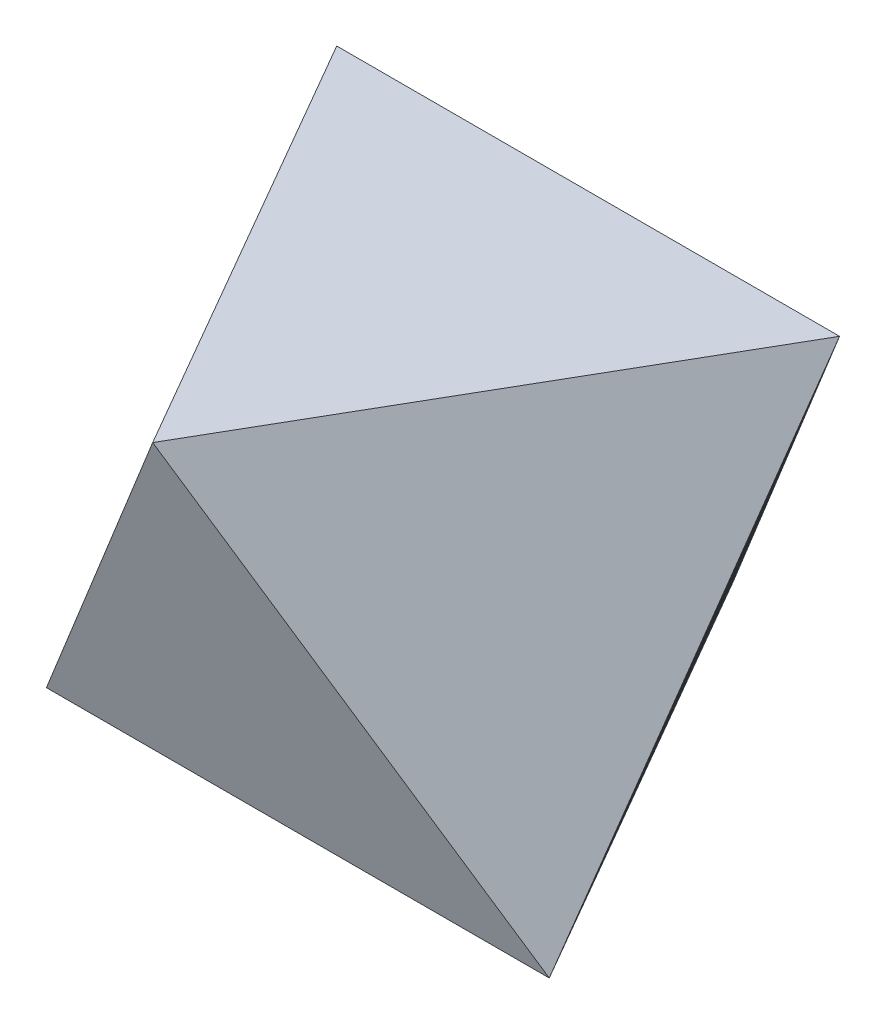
ISO-10303-21;
HEADER;
FILE_DESCRIPTION(('STEP AP214'),'2;1');
FILE_NAME('part.step','',(''),(''),'','','');
FILE_SCHEMA(('AUTOMOTIVE_DESIGN { 1 0 10303 214 1 1 1 1 }'));
ENDSEC;
DATA;
#1=APPLICATION_CONTEXT('core data for automotive mechanical design processes');
#2=APPLICATION_PROTOCOL_DEFINITION('international standard','automotive_design',2000,#1);
#3=PRODUCT_CONTEXT('',#1,'mechanical');
#4=PRODUCT('Part','Part','',(#3));
#5=PRODUCT_RELATED_PRODUCT_CATEGORY('part','',(#4));
#6=PRODUCT_DEFINITION_FORMATION('','',#4);
#7=PRODUCT_DEFINITION_CONTEXT('part definition',#1,'design');
#8=PRODUCT_DEFINITION('design','',#6,#7);
#9=PRODUCT_DEFINITION_SHAPE('','',#8);
#10=(LENGTH_UNIT() NAMED_UNIT(*) SI_UNIT(.MILLI.,.METRE.));
#11=(NAMED_UNIT(*) PLANE_ANGLE_UNIT() SI_UNIT($,.RADIAN.));
#12=(NAMED_UNIT(*) SI_UNIT($,.STERADIAN.) SOLID_ANGLE_UNIT());
#13=UNCERTAINTY_MEASURE_WITH_UNIT(LENGTH_MEASURE(1.E-05),#10,'distance_accuracy_value','');
#14=(GEOMETRIC_REPRESENTATION_CONTEXT(3) GLOBAL_UNCERTAINTY_ASSIGNED_CONTEXT((#13)) GLOBAL_UNIT_ASSIGNED_CONTEXT((#10,
#11,#12)) REPRESENTATION_CONTEXT('',''));
#15=CARTESIAN_POINT('',(0.,0.,0.));
#16=DIRECTION('',(0.,0.,1.));
#17=DIRECTION('',(1.,0.,0.));
#18=AXIS2_PLACEMENT_3D('',#15,#16,#17);
#19=CARTESIAN_POINT('',(0.,0.,0.));
#20=DIRECTION('',(0.,1.,0.));
#21=DIRECTION('',(0.,0.,1.));
#22=AXIS2_PLACEMENT_3D('',#19,#20,#21);
#23=PLANE('',#22);
#24=DIRECTION('',(-0.500000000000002,0.,-0.866025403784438));
#25=VECTOR('',#24,1.);
#26=CARTESIAN_POINT('',(249.999999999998,-3.88578058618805E-13,144.337567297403));
#27=LINE('',#26,#25);
#28=CARTESIAN_POINT('',(250.,6.66133814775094E-13,144.337567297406));
#29=VERTEX_POINT('',#28);
#30=CARTESIAN_POINT('',(0.,-6.38378239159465E-13,-288.675134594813));
#31=VERTEX_POINT('',#30);
#32=EDGE_CURVE('E72',#29,#31,#27,.T.);
#33=ORIENTED_EDGE('',*,*,#32,.F.);
#34=DIRECTION('',(-1.,0.,0.));
#35=VECTOR('',#34,1.);
#36=CARTESIAN_POINT('',(250.,1.80411241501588E-12,144.337567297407));
#37=LINE('',#36,#35);
#38=CARTESIAN_POINT('',(-250.,0.,144.337567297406));
#39=VERTEX_POINT('',#38);
#40=EDGE_CURVE('E42',#29,#39,#37,.T.);
#41=ORIENTED_EDGE('',*,*,#40,.T.);
#42=DIRECTION('',(0.500000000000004,0.,-0.866025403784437));
#43=VECTOR('',#42,1.);
#44=CARTESIAN_POINT('',(-250.,0.,144.337567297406));
#45=LINE('',#44,#43);
#46=EDGE_CURVE('E75',#39,#31,#45,.T.);
#47=ORIENTED_EDGE('',*,*,#46,.T.);
#48=EDGE_LOOP('',(#33,#41,#47));
#49=FACE_BOUND('',#48,.T.);
#50=ADVANCED_FACE('F39',(#49),#23,.F.);
#51=CARTESIAN_POINT('',(-5.55111512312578E-13,136.082763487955,192.450089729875));
#52=DIRECTION('',(0.,0.333333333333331,-0.942809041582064));
#53=DIRECTION('',(-0.866025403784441,0.471404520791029,0.166666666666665));
#54=AXIS2_PLACEMENT_3D('',#51,#52,#53);
#55=PLANE('',#54);
#56=DIRECTION('',(0.500000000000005,-0.816496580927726,-0.288675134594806));
#57=VECTOR('',#56,1.);
#58=CARTESIAN_POINT('',(-1.30451205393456E-12,408.248290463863,288.675134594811));
#59=LINE('',#58,#57);
#60=CARTESIAN_POINT('',(-1.03042574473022E-12,408.248290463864,288.675134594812));
#61=VERTEX_POINT('',#60);
#62=EDGE_CURVE('E84',#61,#29,#59,.T.);
#63=ORIENTED_EDGE('',*,*,#62,.F.);
#64=DIRECTION('',(-0.5,-0.816496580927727,-0.28867513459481));
#65=VECTOR('',#64,1.);
#66=CARTESIAN_POINT('',(-1.66533453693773E-13,408.248290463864,288.675134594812));
#67=LINE('',#66,#65);
#68=EDGE_CURVE('E81',#61,#39,#67,.T.);
#69=ORIENTED_EDGE('',*,*,#68,.T.);
#70=ORIENTED_EDGE('',*,*,#40,.F.);
#71=EDGE_LOOP('',(#63,#69,#70));
#72=FACE_BOUND('',#71,.T.);
#73=ADVANCED_FACE('F82',(#72),#55,.F.);
#74=CARTESIAN_POINT('',(-166.666666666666,136.082763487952,-96.2250448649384));
#75=DIRECTION('',(0.816496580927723,0.333333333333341,0.471404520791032));
#76=DIRECTION('',(0.288675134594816,-0.942809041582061,0.166666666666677));
#77=AXIS2_PLACEMENT_3D('',#74,#75,#76);
#78=PLANE('',#77);
#79=DIRECTION('',(-0.500000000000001,0.816496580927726,0.288675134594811));
#80=VECTOR('',#79,1.);
#81=CARTESIAN_POINT('',(-1.95676808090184E-12,1.22124532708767E-12,-288.675134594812));
#82=LINE('',#81,#80);
#83=CARTESIAN_POINT('',(-250.000000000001,408.248290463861,-144.337567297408));
#84=VERTEX_POINT('',#83);
#85=EDGE_CURVE('E91',#31,#84,#82,.T.);
#86=ORIENTED_EDGE('',*,*,#85,.F.);
#87=ORIENTED_EDGE('',*,*,#46,.F.);
#88=DIRECTION('',(0.,0.816496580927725,-0.577350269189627));
#89=VECTOR('',#88,1.);
#90=CARTESIAN_POINT('',(-250.,-1.11022302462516E-13,144.337567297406));
#91=LINE('',#90,#89);
#92=EDGE_CURVE('E58',#39,#84,#91,.T.);
#93=ORIENTED_EDGE('',*,*,#92,.T.);
#94=EDGE_LOOP('',(#86,#87,#93));
#95=FACE_BOUND('',#94,.T.);
#96=ADVANCED_FACE('F89',(#95),#78,.F.);
#97=CARTESIAN_POINT('',(166.666666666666,136.082763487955,-96.2250448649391));
#98=DIRECTION('',(0.816496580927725,-0.333333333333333,-0.471404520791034));
#99=DIRECTION('',(-0.577350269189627,-0.471404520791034,-0.666666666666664));
#100=AXIS2_PLACEMENT_3D('',#97,#98,#99);
#101=PLANE('',#100);
#102=ORIENTED_EDGE('',*,*,#32,.T.);
#103=DIRECTION('',(-0.500000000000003,-0.816496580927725,-0.28867513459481));
#104=VECTOR('',#103,1.);
#105=CARTESIAN_POINT('',(249.999999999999,408.248290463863,-144.337567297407));
#106=LINE('',#105,#104);
#107=CARTESIAN_POINT('',(249.999999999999,408.248290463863,-144.337567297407));
#108=VERTEX_POINT('',#107);
#109=EDGE_CURVE('E113',#108,#31,#106,.T.);
#110=ORIENTED_EDGE('',*,*,#109,.F.);
#111=DIRECTION('',(0.,0.816496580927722,-0.577350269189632));
#112=VECTOR('',#111,1.);
#113=CARTESIAN_POINT('',(250.,2.1094237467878E-12,144.337567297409));
#114=LINE('',#113,#112);
#115=EDGE_CURVE('E102',#29,#108,#114,.T.);
#116=ORIENTED_EDGE('',*,*,#115,.F.);
#117=EDGE_LOOP('',(#102,#110,#116));
#118=FACE_BOUND('',#117,.T.);
#119=ADVANCED_FACE('F112',(#118),#101,.T.);
#120=CARTESIAN_POINT('',(-166.666666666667,272.165526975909,96.225044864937));
#121=DIRECTION('',(0.816496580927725,-0.333333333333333,-0.471404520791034));
#122=DIRECTION('',(-0.577350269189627,-0.471404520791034,-0.666666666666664));
#123=AXIS2_PLACEMENT_3D('',#120,#121,#122);
#124=PLANE('',#123);
#125=DIRECTION('',(0.500000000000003,0.,0.866025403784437));
#126=VECTOR('',#125,1.);
#127=CARTESIAN_POINT('',(-250.,408.248290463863,-144.337567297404));
#128=LINE('',#127,#126);
#129=EDGE_CURVE('E95',#84,#61,#128,.T.);
#130=ORIENTED_EDGE('',*,*,#129,.F.);
#131=ORIENTED_EDGE('',*,*,#92,.F.);
#132=ORIENTED_EDGE('',*,*,#68,.F.);
#133=EDGE_LOOP('',(#130,#131,#132));
#134=FACE_BOUND('',#133,.T.);
#135=ADVANCED_FACE('F93',(#134),#124,.F.);
#136=CARTESIAN_POINT('',(166.666666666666,272.16552697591,96.2250448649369));
#137=DIRECTION('',(0.816496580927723,0.333333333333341,0.471404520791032));
#138=DIRECTION('',(0.288675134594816,-0.942809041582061,0.166666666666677));
#139=AXIS2_PLACEMENT_3D('',#136,#137,#138);
#140=PLANE('',#139);
#141=ORIENTED_EDGE('',*,*,#62,.T.);
#142=ORIENTED_EDGE('',*,*,#115,.T.);
#143=DIRECTION('',(0.499999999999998,0.,-0.86602540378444));
#144=VECTOR('',#143,1.);
#145=CARTESIAN_POINT('',(0.,408.248290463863,288.675134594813));
#146=LINE('',#145,#144);
#147=EDGE_CURVE('E49',#61,#108,#146,.T.);
#148=ORIENTED_EDGE('',*,*,#147,.F.);
#149=EDGE_LOOP('',(#141,#142,#148));
#150=FACE_BOUND('',#149,.T.);
#151=ADVANCED_FACE('F135',(#150),#140,.T.);
#152=CARTESIAN_POINT('',(-7.81734838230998E-13,272.165526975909,-192.450089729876));
#153=DIRECTION('',(0.,0.333333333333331,-0.942809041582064));
#154=DIRECTION('',(-0.866025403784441,0.471404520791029,0.166666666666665));
#155=AXIS2_PLACEMENT_3D('',#152,#153,#154);
#156=PLANE('',#155);
#157=ORIENTED_EDGE('',*,*,#85,.T.);
#158=DIRECTION('',(-1.,0.,0.));
#159=VECTOR('',#158,1.);
#160=CARTESIAN_POINT('',(249.999999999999,408.248290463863,-144.337567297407));
#161=LINE('',#160,#159);
#162=EDGE_CURVE('E11',#108,#84,#161,.T.);
#163=ORIENTED_EDGE('',*,*,#162,.F.);
#164=ORIENTED_EDGE('',*,*,#109,.T.);
#165=EDGE_LOOP('',(#157,#163,#164));
#166=FACE_BOUND('',#165,.T.);
#167=ADVANCED_FACE('F117',(#166),#156,.T.);
#168=CARTESIAN_POINT('',(0.,408.248290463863,0.));
#169=DIRECTION('',(0.,1.,0.));
#170=DIRECTION('',(0.,0.,1.));
#171=AXIS2_PLACEMENT_3D('',#168,#169,#170);
#172=PLANE('',#171);
#173=ORIENTED_EDGE('',*,*,#129,.T.);
#174=ORIENTED_EDGE('',*,*,#147,.T.);
#175=ORIENTED_EDGE('',*,*,#162,.T.);
#176=EDGE_LOOP('',(#173,#174,#175));
#177=FACE_BOUND('',#176,.T.);
#178=ADVANCED_FACE('F139',(#177),#172,.T.);
#179=CLOSED_SHELL('',(#50,#73,#96,#119,#135,#151,#167,#178));
#180=MANIFOLD_SOLID_BREP('B2',#179);
#181=ADVANCED_BREP_SHAPE_REPRESENTATION('',(#18,#180),#14);
#182=SHAPE_DEFINITION_REPRESENTATION(#9,#181);
ENDSEC;
END-ISO-10303-21;
